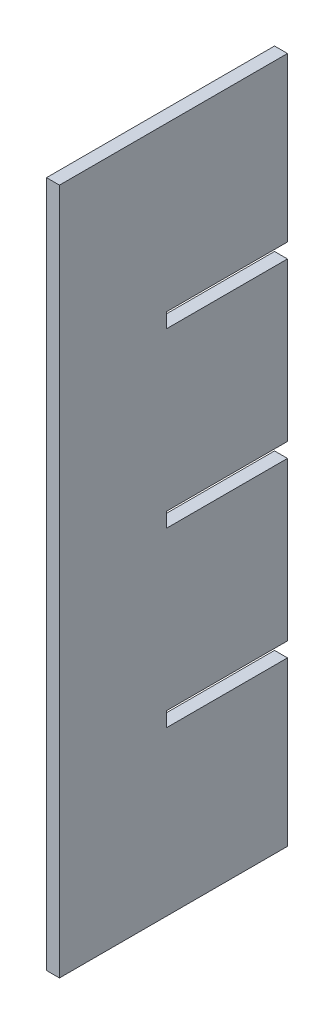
ISO-10303-21;
HEADER;
FILE_DESCRIPTION(('STEP AP214'),'2;1');
FILE_NAME('part.step','',(''),(''),'','','');
FILE_SCHEMA(('AUTOMOTIVE_DESIGN { 1 0 10303 214 1 1 1 1 }'));
ENDSEC;
DATA;
#1=APPLICATION_CONTEXT('core data for automotive mechanical design processes');
#2=APPLICATION_PROTOCOL_DEFINITION('international standard','automotive_design',2000,#1);
#3=PRODUCT_CONTEXT('',#1,'mechanical');
#4=PRODUCT('Part','Part','',(#3));
#5=PRODUCT_RELATED_PRODUCT_CATEGORY('part','',(#4));
#6=PRODUCT_DEFINITION_FORMATION('','',#4);
#7=PRODUCT_DEFINITION_CONTEXT('part definition',#1,'design');
#8=PRODUCT_DEFINITION('design','',#6,#7);
#9=PRODUCT_DEFINITION_SHAPE('','',#8);
#10=(LENGTH_UNIT() NAMED_UNIT(*) SI_UNIT(.MILLI.,.METRE.));
#11=(NAMED_UNIT(*) PLANE_ANGLE_UNIT() SI_UNIT($,.RADIAN.));
#12=(NAMED_UNIT(*) SI_UNIT($,.STERADIAN.) SOLID_ANGLE_UNIT());
#13=UNCERTAINTY_MEASURE_WITH_UNIT(LENGTH_MEASURE(1.E-05),#10,'distance_accuracy_value','');
#14=(GEOMETRIC_REPRESENTATION_CONTEXT(3) GLOBAL_UNCERTAINTY_ASSIGNED_CONTEXT((#13)) GLOBAL_UNIT_ASSIGNED_CONTEXT((#10,
#11,#12)) REPRESENTATION_CONTEXT('',''));
#15=CARTESIAN_POINT('',(0.,0.,0.));
#16=DIRECTION('',(0.,0.,1.));
#17=DIRECTION('',(1.,0.,0.));
#18=AXIS2_PLACEMENT_3D('',#15,#16,#17);
#19=CARTESIAN_POINT('',(0.,0.,0.));
#20=DIRECTION('',(0.,0.,-1.));
#21=DIRECTION('',(-1.,0.,0.));
#22=AXIS2_PLACEMENT_3D('',#19,#20,#21);
#23=PLANE('',#22);
#24=DIRECTION('',(1.,0.,0.));
#25=VECTOR('',#24,1.);
#26=CARTESIAN_POINT('',(-32.352836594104,19.15,0.));
#27=LINE('',#26,#25);
#28=CARTESIAN_POINT('',(-18.25,19.15,0.));
#29=VERTEX_POINT('',#28);
#30=CARTESIAN_POINT('',(-16.75,19.15,0.));
#31=VERTEX_POINT('',#30);
#32=EDGE_CURVE('E413',#29,#31,#27,.T.);
#33=ORIENTED_EDGE('',*,*,#32,.T.);
#34=DIRECTION('',(0.,1.,0.));
#35=VECTOR('',#34,1.);
#36=CARTESIAN_POINT('',(-16.75,-39.75,0.));
#37=LINE('',#36,#35);
#38=CARTESIAN_POINT('',(-16.75,0.849999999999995,0.));
#39=VERTEX_POINT('',#38);
#40=EDGE_CURVE('E172',#39,#31,#37,.T.);
#41=ORIENTED_EDGE('',*,*,#40,.F.);
#42=DIRECTION('',(1.,0.,0.));
#43=VECTOR('',#42,1.);
#44=CARTESIAN_POINT('',(-32.352836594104,0.849999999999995,0.));
#45=LINE('',#44,#43);
#46=CARTESIAN_POINT('',(-18.25,0.849999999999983,0.));
#47=VERTEX_POINT('',#46);
#48=EDGE_CURVE('E215',#47,#39,#45,.T.);
#49=ORIENTED_EDGE('',*,*,#48,.F.);
#50=DIRECTION('',(0.,-1.,0.));
#51=VECTOR('',#50,1.);
#52=CARTESIAN_POINT('',(-18.25,-39.75,0.));
#53=LINE('',#52,#51);
#54=EDGE_CURVE('E56',#29,#47,#53,.T.);
#55=ORIENTED_EDGE('',*,*,#54,.F.);
#56=EDGE_LOOP('',(#33,#41,#49,#55));
#57=FACE_BOUND('',#56,.T.);
#58=ADVANCED_FACE('F33',(#57),#23,.T.);
#59=DIRECTION('',(1.,0.,0.));
#60=VECTOR('',#59,1.);
#61=CARTESIAN_POINT('',(-32.352836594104,-0.850000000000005,0.));
#62=LINE('',#61,#60);
#63=CARTESIAN_POINT('',(-18.25,-0.850000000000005,0.));
#64=VERTEX_POINT('',#63);
#65=CARTESIAN_POINT('',(-16.75,-0.850000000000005,0.));
#66=VERTEX_POINT('',#65);
#67=EDGE_CURVE('E200',#64,#66,#62,.T.);
#68=ORIENTED_EDGE('',*,*,#67,.T.);
#69=CARTESIAN_POINT('',(-16.75,-19.15,0.));
#70=VERTEX_POINT('',#69);
#71=EDGE_CURVE('E176',#70,#66,#37,.T.);
#72=ORIENTED_EDGE('',*,*,#71,.F.);
#73=DIRECTION('',(1.,0.,0.));
#74=VECTOR('',#73,1.);
#75=CARTESIAN_POINT('',(-32.352836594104,-19.15,0.));
#76=LINE('',#75,#74);
#77=CARTESIAN_POINT('',(-18.25,-19.15,0.));
#78=VERTEX_POINT('',#77);
#79=EDGE_CURVE('E199',#78,#70,#76,.T.);
#80=ORIENTED_EDGE('',*,*,#79,.F.);
#81=EDGE_CURVE('E201',#64,#78,#53,.T.);
#82=ORIENTED_EDGE('',*,*,#81,.F.);
#83=EDGE_LOOP('',(#68,#72,#80,#82));
#84=FACE_BOUND('',#83,.T.);
#85=ADVANCED_FACE('F197',(#84),#23,.T.);
#86=DIRECTION('',(1.,0.,0.));
#87=VECTOR('',#86,1.);
#88=CARTESIAN_POINT('',(-32.352836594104,-20.85,0.));
#89=LINE('',#88,#87);
#90=CARTESIAN_POINT('',(-18.25,-20.85,0.));
#91=VERTEX_POINT('',#90);
#92=CARTESIAN_POINT('',(-16.75,-20.85,0.));
#93=VERTEX_POINT('',#92);
#94=EDGE_CURVE('E222',#91,#93,#89,.T.);
#95=ORIENTED_EDGE('',*,*,#94,.T.);
#96=CARTESIAN_POINT('',(-16.75,-39.75,0.));
#97=VERTEX_POINT('',#96);
#98=EDGE_CURVE('E175',#97,#93,#37,.T.);
#99=ORIENTED_EDGE('',*,*,#98,.F.);
#100=DIRECTION('',(1.,0.,0.));
#101=VECTOR('',#100,1.);
#102=CARTESIAN_POINT('',(-18.25,-39.75,0.));
#103=LINE('',#102,#101);
#104=CARTESIAN_POINT('',(-18.25,-39.75,0.));
#105=VERTEX_POINT('',#104);
#106=EDGE_CURVE('E173',#105,#97,#103,.T.);
#107=ORIENTED_EDGE('',*,*,#106,.F.);
#108=EDGE_CURVE('E240',#91,#105,#53,.T.);
#109=ORIENTED_EDGE('',*,*,#108,.F.);
#110=EDGE_LOOP('',(#95,#99,#107,#109));
#111=FACE_BOUND('',#110,.T.);
#112=ADVANCED_FACE('F267',(#111),#23,.T.);
#113=CARTESIAN_POINT('',(-18.25,-39.75,26.4));
#114=DIRECTION('',(1.,0.,0.));
#115=DIRECTION('',(0.,0.,-1.));
#116=AXIS2_PLACEMENT_3D('',#113,#114,#115);
#117=PLANE('',#116);
#118=DIRECTION('',(0.,1.,0.));
#119=VECTOR('',#118,1.);
#120=CARTESIAN_POINT('',(-18.25,19.15,14.));
#121=LINE('',#120,#119);
#122=CARTESIAN_POINT('',(-18.25,19.15,14.));
#123=VERTEX_POINT('',#122);
#124=CARTESIAN_POINT('',(-18.25,20.85,14.));
#125=VERTEX_POINT('',#124);
#126=EDGE_CURVE('E410',#123,#125,#121,.T.);
#127=ORIENTED_EDGE('',*,*,#126,.F.);
#128=DIRECTION('',(0.,0.,1.));
#129=VECTOR('',#128,1.);
#130=CARTESIAN_POINT('',(-18.25,19.15,0.));
#131=LINE('',#130,#129);
#132=EDGE_CURVE('E412',#29,#123,#131,.T.);
#133=ORIENTED_EDGE('',*,*,#132,.F.);
#134=ORIENTED_EDGE('',*,*,#54,.T.);
#135=DIRECTION('',(0.,0.,-1.));
#136=VECTOR('',#135,1.);
#137=CARTESIAN_POINT('',(-18.25,0.849999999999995,0.));
#138=LINE('',#137,#136);
#139=CARTESIAN_POINT('',(-18.25,0.849999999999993,14.));
#140=VERTEX_POINT('',#139);
#141=EDGE_CURVE('E217',#140,#47,#138,.T.);
#142=ORIENTED_EDGE('',*,*,#141,.F.);
#143=DIRECTION('',(0.,1.,0.));
#144=VECTOR('',#143,1.);
#145=CARTESIAN_POINT('',(-18.25,-0.850000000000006,14.));
#146=LINE('',#145,#144);
#147=CARTESIAN_POINT('',(-18.25,-0.850000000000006,14.));
#148=VERTEX_POINT('',#147);
#149=EDGE_CURVE('E204',#148,#140,#146,.T.);
#150=ORIENTED_EDGE('',*,*,#149,.F.);
#151=DIRECTION('',(0.,0.,1.));
#152=VECTOR('',#151,1.);
#153=CARTESIAN_POINT('',(-18.25,-0.850000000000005,0.));
#154=LINE('',#153,#152);
#155=EDGE_CURVE('E207',#64,#148,#154,.T.);
#156=ORIENTED_EDGE('',*,*,#155,.F.);
#157=ORIENTED_EDGE('',*,*,#81,.T.);
#158=DIRECTION('',(0.,0.,-1.));
#159=VECTOR('',#158,1.);
#160=CARTESIAN_POINT('',(-18.25,-19.15,0.));
#161=LINE('',#160,#159);
#162=CARTESIAN_POINT('',(-18.25,-19.15,14.));
#163=VERTEX_POINT('',#162);
#164=EDGE_CURVE('E224',#163,#78,#161,.T.);
#165=ORIENTED_EDGE('',*,*,#164,.F.);
#166=DIRECTION('',(0.,1.,0.));
#167=VECTOR('',#166,1.);
#168=CARTESIAN_POINT('',(-18.25,-20.85,14.));
#169=LINE('',#168,#167);
#170=CARTESIAN_POINT('',(-18.25,-20.85,14.));
#171=VERTEX_POINT('',#170);
#172=EDGE_CURVE('E219',#171,#163,#169,.T.);
#173=ORIENTED_EDGE('',*,*,#172,.F.);
#174=DIRECTION('',(0.,0.,1.));
#175=VECTOR('',#174,1.);
#176=CARTESIAN_POINT('',(-18.25,-20.85,0.));
#177=LINE('',#176,#175);
#178=EDGE_CURVE('E221',#91,#171,#177,.T.);
#179=ORIENTED_EDGE('',*,*,#178,.F.);
#180=ORIENTED_EDGE('',*,*,#108,.T.);
#181=DIRECTION('',(0.,0.,-1.));
#182=VECTOR('',#181,1.);
#183=CARTESIAN_POINT('',(-18.25,-39.75,26.4));
#184=LINE('',#183,#182);
#185=CARTESIAN_POINT('',(-18.25,-39.75,26.4));
#186=VERTEX_POINT('',#185);
#187=EDGE_CURVE('E11',#186,#105,#184,.T.);
#188=ORIENTED_EDGE('',*,*,#187,.F.);
#189=DIRECTION('',(0.,-1.,0.));
#190=VECTOR('',#189,1.);
#191=CARTESIAN_POINT('',(-18.25,-39.75,26.4));
#192=LINE('',#191,#190);
#193=CARTESIAN_POINT('',(-18.25,39.75,26.4));
#194=VERTEX_POINT('',#193);
#195=EDGE_CURVE('E184',#194,#186,#192,.T.);
#196=ORIENTED_EDGE('',*,*,#195,.F.);
#197=DIRECTION('',(0.,0.,-1.));
#198=VECTOR('',#197,1.);
#199=CARTESIAN_POINT('',(-18.25,39.75,26.4));
#200=LINE('',#199,#198);
#201=CARTESIAN_POINT('',(-18.25,39.75,0.));
#202=VERTEX_POINT('',#201);
#203=EDGE_CURVE('E249',#194,#202,#200,.T.);
#204=ORIENTED_EDGE('',*,*,#203,.T.);
#205=CARTESIAN_POINT('',(-18.25,20.85,0.));
#206=VERTEX_POINT('',#205);
#207=EDGE_CURVE('E177',#202,#206,#53,.T.);
#208=ORIENTED_EDGE('',*,*,#207,.T.);
#209=DIRECTION('',(0.,0.,-1.));
#210=VECTOR('',#209,1.);
#211=CARTESIAN_POINT('',(-18.25,20.85,0.));
#212=LINE('',#211,#210);
#213=EDGE_CURVE('E48',#125,#206,#212,.T.);
#214=ORIENTED_EDGE('',*,*,#213,.F.);
#215=EDGE_LOOP('',(#127,#133,#134,#142,#150,#156,#157,#165,#173,#179,#180,#188,#196,#204,#208,#214));
#216=FACE_BOUND('',#215,.T.);
#217=ADVANCED_FACE('F35',(#216),#117,.F.);
#218=CARTESIAN_POINT('',(-18.25,-39.75,26.4));
#219=DIRECTION('',(0.,1.,0.));
#220=DIRECTION('',(0.,0.,1.));
#221=AXIS2_PLACEMENT_3D('',#218,#219,#220);
#222=PLANE('',#221);
#223=ORIENTED_EDGE('',*,*,#106,.T.);
#224=DIRECTION('',(0.,0.,-1.));
#225=VECTOR('',#224,1.);
#226=CARTESIAN_POINT('',(-16.75,-39.75,26.4));
#227=LINE('',#226,#225);
#228=CARTESIAN_POINT('',(-16.75,-39.75,26.4));
#229=VERTEX_POINT('',#228);
#230=EDGE_CURVE('E41',#229,#97,#227,.T.);
#231=ORIENTED_EDGE('',*,*,#230,.F.);
#232=DIRECTION('',(1.,0.,0.));
#233=VECTOR('',#232,1.);
#234=CARTESIAN_POINT('',(-18.25,-39.75,26.4));
#235=LINE('',#234,#233);
#236=EDGE_CURVE('E243',#186,#229,#235,.T.);
#237=ORIENTED_EDGE('',*,*,#236,.F.);
#238=ORIENTED_EDGE('',*,*,#187,.T.);
#239=EDGE_LOOP('',(#223,#231,#237,#238));
#240=FACE_BOUND('',#239,.T.);
#241=ADVANCED_FACE('F270',(#240),#222,.F.);
#242=CARTESIAN_POINT('',(-16.75,-39.75,26.4));
#243=DIRECTION('',(-1.,0.,0.));
#244=DIRECTION('',(0.,0.,1.));
#245=AXIS2_PLACEMENT_3D('',#242,#243,#244);
#246=PLANE('',#245);
#247=ORIENTED_EDGE('',*,*,#40,.T.);
#248=DIRECTION('',(0.,0.,-1.));
#249=VECTOR('',#248,1.);
#250=CARTESIAN_POINT('',(-16.75,19.15,0.));
#251=LINE('',#250,#249);
#252=CARTESIAN_POINT('',(-16.75,19.15,14.));
#253=VERTEX_POINT('',#252);
#254=EDGE_CURVE('E157',#253,#31,#251,.T.);
#255=ORIENTED_EDGE('',*,*,#254,.F.);
#256=DIRECTION('',(0.,-1.,0.));
#257=VECTOR('',#256,1.);
#258=CARTESIAN_POINT('',(-16.75,19.15,14.));
#259=LINE('',#258,#257);
#260=CARTESIAN_POINT('',(-16.75,20.85,14.));
#261=VERTEX_POINT('',#260);
#262=EDGE_CURVE('E167',#261,#253,#259,.T.);
#263=ORIENTED_EDGE('',*,*,#262,.F.);
#264=DIRECTION('',(0.,0.,1.));
#265=VECTOR('',#264,1.);
#266=CARTESIAN_POINT('',(-16.75,20.85,0.));
#267=LINE('',#266,#265);
#268=CARTESIAN_POINT('',(-16.75,20.85,0.));
#269=VERTEX_POINT('',#268);
#270=EDGE_CURVE('E150',#269,#261,#267,.T.);
#271=ORIENTED_EDGE('',*,*,#270,.F.);
#272=CARTESIAN_POINT('',(-16.75,39.75,0.));
#273=VERTEX_POINT('',#272);
#274=EDGE_CURVE('E163',#269,#273,#37,.T.);
#275=ORIENTED_EDGE('',*,*,#274,.T.);
#276=DIRECTION('',(0.,0.,-1.));
#277=VECTOR('',#276,1.);
#278=CARTESIAN_POINT('',(-16.75,39.75,26.4));
#279=LINE('',#278,#277);
#280=CARTESIAN_POINT('',(-16.75,39.75,26.4));
#281=VERTEX_POINT('',#280);
#282=EDGE_CURVE('E279',#281,#273,#279,.T.);
#283=ORIENTED_EDGE('',*,*,#282,.F.);
#284=DIRECTION('',(0.,1.,0.));
#285=VECTOR('',#284,1.);
#286=CARTESIAN_POINT('',(-16.75,-39.75,26.4));
#287=LINE('',#286,#285);
#288=EDGE_CURVE('E245',#229,#281,#287,.T.);
#289=ORIENTED_EDGE('',*,*,#288,.F.);
#290=ORIENTED_EDGE('',*,*,#230,.T.);
#291=ORIENTED_EDGE('',*,*,#98,.T.);
#292=DIRECTION('',(0.,0.,-1.));
#293=VECTOR('',#292,1.);
#294=CARTESIAN_POINT('',(-16.75,-20.85,0.));
#295=LINE('',#294,#293);
#296=CARTESIAN_POINT('',(-16.75,-20.85,14.));
#297=VERTEX_POINT('',#296);
#298=EDGE_CURVE('E229',#297,#93,#295,.T.);
#299=ORIENTED_EDGE('',*,*,#298,.F.);
#300=DIRECTION('',(0.,-1.,0.));
#301=VECTOR('',#300,1.);
#302=CARTESIAN_POINT('',(-16.75,-20.85,14.));
#303=LINE('',#302,#301);
#304=CARTESIAN_POINT('',(-16.75,-19.15,14.));
#305=VERTEX_POINT('',#304);
#306=EDGE_CURVE('E226',#305,#297,#303,.T.);
#307=ORIENTED_EDGE('',*,*,#306,.F.);
#308=DIRECTION('',(0.,0.,1.));
#309=VECTOR('',#308,1.);
#310=CARTESIAN_POINT('',(-16.75,-19.15,0.));
#311=LINE('',#310,#309);
#312=EDGE_CURVE('E193',#70,#305,#311,.T.);
#313=ORIENTED_EDGE('',*,*,#312,.F.);
#314=ORIENTED_EDGE('',*,*,#71,.T.);
#315=DIRECTION('',(0.,0.,-1.));
#316=VECTOR('',#315,1.);
#317=CARTESIAN_POINT('',(-16.75,-0.850000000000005,0.));
#318=LINE('',#317,#316);
#319=CARTESIAN_POINT('',(-16.75,-0.850000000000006,14.));
#320=VERTEX_POINT('',#319);
#321=EDGE_CURVE('E190',#320,#66,#318,.T.);
#322=ORIENTED_EDGE('',*,*,#321,.F.);
#323=DIRECTION('',(0.,-1.,0.));
#324=VECTOR('',#323,1.);
#325=CARTESIAN_POINT('',(-16.75,-0.850000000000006,14.));
#326=LINE('',#325,#324);
#327=CARTESIAN_POINT('',(-16.75,0.849999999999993,14.));
#328=VERTEX_POINT('',#327);
#329=EDGE_CURVE('E419',#328,#320,#326,.T.);
#330=ORIENTED_EDGE('',*,*,#329,.F.);
#331=DIRECTION('',(0.,0.,1.));
#332=VECTOR('',#331,1.);
#333=CARTESIAN_POINT('',(-16.75,0.849999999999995,0.));
#334=LINE('',#333,#332);
#335=EDGE_CURVE('E416',#39,#328,#334,.T.);
#336=ORIENTED_EDGE('',*,*,#335,.F.);
#337=EDGE_LOOP('',(#247,#255,#263,#271,#275,#283,#289,#290,#291,#299,#307,#313,#314,#322,#330,#336));
#338=FACE_BOUND('',#337,.T.);
#339=ADVANCED_FACE('F161',(#338),#246,.F.);
#340=CARTESIAN_POINT('',(-18.25,39.75,26.4));
#341=DIRECTION('',(0.,-1.,0.));
#342=DIRECTION('',(0.,0.,-1.));
#343=AXIS2_PLACEMENT_3D('',#340,#341,#342);
#344=PLANE('',#343);
#345=DIRECTION('',(-1.,0.,0.));
#346=VECTOR('',#345,1.);
#347=CARTESIAN_POINT('',(-18.25,39.75,0.));
#348=LINE('',#347,#346);
#349=EDGE_CURVE('E171',#273,#202,#348,.T.);
#350=ORIENTED_EDGE('',*,*,#349,.T.);
#351=ORIENTED_EDGE('',*,*,#203,.F.);
#352=DIRECTION('',(-1.,0.,0.));
#353=VECTOR('',#352,1.);
#354=CARTESIAN_POINT('',(-18.25,39.75,26.4));
#355=LINE('',#354,#353);
#356=EDGE_CURVE('E247',#281,#194,#355,.T.);
#357=ORIENTED_EDGE('',*,*,#356,.F.);
#358=ORIENTED_EDGE('',*,*,#282,.T.);
#359=EDGE_LOOP('',(#350,#351,#357,#358));
#360=FACE_BOUND('',#359,.T.);
#361=ADVANCED_FACE('F278',(#360),#344,.F.);
#362=CARTESIAN_POINT('',(0.,0.,26.4));
#363=DIRECTION('',(0.,0.,-1.));
#364=DIRECTION('',(-1.,0.,0.));
#365=AXIS2_PLACEMENT_3D('',#362,#363,#364);
#366=PLANE('',#365);
#367=ORIENTED_EDGE('',*,*,#195,.T.);
#368=ORIENTED_EDGE('',*,*,#236,.T.);
#369=ORIENTED_EDGE('',*,*,#288,.T.);
#370=ORIENTED_EDGE('',*,*,#356,.T.);
#371=EDGE_LOOP('',(#367,#368,#369,#370));
#372=FACE_BOUND('',#371,.T.);
#373=ADVANCED_FACE('F274',(#372),#366,.F.);
#374=DIRECTION('',(1.,0.,0.));
#375=VECTOR('',#374,1.);
#376=CARTESIAN_POINT('',(-32.352836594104,20.85,0.));
#377=LINE('',#376,#375);
#378=EDGE_CURVE('E147',#206,#269,#377,.T.);
#379=ORIENTED_EDGE('',*,*,#378,.F.);
#380=ORIENTED_EDGE('',*,*,#207,.F.);
#381=ORIENTED_EDGE('',*,*,#349,.F.);
#382=ORIENTED_EDGE('',*,*,#274,.F.);
#383=EDGE_LOOP('',(#379,#380,#381,#382));
#384=FACE_BOUND('',#383,.T.);
#385=ADVANCED_FACE('F170',(#384),#23,.T.);
#386=CARTESIAN_POINT('',(-32.352836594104,-20.85,0.));
#387=DIRECTION('',(0.,-1.,0.));
#388=DIRECTION('',(0.,0.,-1.));
#389=AXIS2_PLACEMENT_3D('',#386,#387,#388);
#390=PLANE('',#389);
#391=ORIENTED_EDGE('',*,*,#178,.T.);
#392=DIRECTION('',(1.,0.,0.));
#393=VECTOR('',#392,1.);
#394=CARTESIAN_POINT('',(-32.352836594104,-20.85,14.));
#395=LINE('',#394,#393);
#396=EDGE_CURVE('E233',#171,#297,#395,.T.);
#397=ORIENTED_EDGE('',*,*,#396,.T.);
#398=ORIENTED_EDGE('',*,*,#298,.T.);
#399=ORIENTED_EDGE('',*,*,#94,.F.);
#400=EDGE_LOOP('',(#391,#397,#398,#399));
#401=FACE_BOUND('',#400,.T.);
#402=ADVANCED_FACE('F298',(#401),#390,.F.);
#403=CARTESIAN_POINT('',(-32.352836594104,-20.85,14.));
#404=DIRECTION('',(0.,0.,1.));
#405=DIRECTION('',(1.,0.,0.));
#406=AXIS2_PLACEMENT_3D('',#403,#404,#405);
#407=PLANE('',#406);
#408=ORIENTED_EDGE('',*,*,#172,.T.);
#409=DIRECTION('',(1.,0.,0.));
#410=VECTOR('',#409,1.);
#411=CARTESIAN_POINT('',(-32.352836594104,-19.15,14.));
#412=LINE('',#411,#410);
#413=EDGE_CURVE('E235',#163,#305,#412,.T.);
#414=ORIENTED_EDGE('',*,*,#413,.T.);
#415=ORIENTED_EDGE('',*,*,#306,.T.);
#416=ORIENTED_EDGE('',*,*,#396,.F.);
#417=EDGE_LOOP('',(#408,#414,#415,#416));
#418=FACE_BOUND('',#417,.T.);
#419=ADVANCED_FACE('F263',(#418),#407,.F.);
#420=CARTESIAN_POINT('',(-32.352836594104,-19.15,0.));
#421=DIRECTION('',(0.,1.,0.));
#422=DIRECTION('',(0.,0.,1.));
#423=AXIS2_PLACEMENT_3D('',#420,#421,#422);
#424=PLANE('',#423);
#425=ORIENTED_EDGE('',*,*,#164,.T.);
#426=ORIENTED_EDGE('',*,*,#79,.T.);
#427=ORIENTED_EDGE('',*,*,#312,.T.);
#428=ORIENTED_EDGE('',*,*,#413,.F.);
#429=EDGE_LOOP('',(#425,#426,#427,#428));
#430=FACE_BOUND('',#429,.T.);
#431=ADVANCED_FACE('F261',(#430),#424,.F.);
#432=CARTESIAN_POINT('',(-32.352836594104,-0.850000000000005,0.));
#433=DIRECTION('',(0.,-1.,0.));
#434=DIRECTION('',(0.,0.,-1.));
#435=AXIS2_PLACEMENT_3D('',#432,#433,#434);
#436=PLANE('',#435);
#437=ORIENTED_EDGE('',*,*,#155,.T.);
#438=DIRECTION('',(1.,0.,0.));
#439=VECTOR('',#438,1.);
#440=CARTESIAN_POINT('',(-32.352836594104,-0.850000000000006,14.));
#441=LINE('',#440,#439);
#442=EDGE_CURVE('E205',#148,#320,#441,.T.);
#443=ORIENTED_EDGE('',*,*,#442,.T.);
#444=ORIENTED_EDGE('',*,*,#321,.T.);
#445=ORIENTED_EDGE('',*,*,#67,.F.);
#446=EDGE_LOOP('',(#437,#443,#444,#445));
#447=FACE_BOUND('',#446,.T.);
#448=ADVANCED_FACE('F349',(#447),#436,.F.);
#449=CARTESIAN_POINT('',(-32.352836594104,-0.850000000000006,14.));
#450=DIRECTION('',(0.,0.,1.));
#451=DIRECTION('',(1.,0.,0.));
#452=AXIS2_PLACEMENT_3D('',#449,#450,#451);
#453=PLANE('',#452);
#454=ORIENTED_EDGE('',*,*,#149,.T.);
#455=DIRECTION('',(1.,0.,0.));
#456=VECTOR('',#455,1.);
#457=CARTESIAN_POINT('',(-32.352836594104,0.849999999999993,14.));
#458=LINE('',#457,#456);
#459=EDGE_CURVE('E209',#140,#328,#458,.T.);
#460=ORIENTED_EDGE('',*,*,#459,.T.);
#461=ORIENTED_EDGE('',*,*,#329,.T.);
#462=ORIENTED_EDGE('',*,*,#442,.F.);
#463=EDGE_LOOP('',(#454,#460,#461,#462));
#464=FACE_BOUND('',#463,.T.);
#465=ADVANCED_FACE('F358',(#464),#453,.F.);
#466=CARTESIAN_POINT('',(-32.352836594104,0.849999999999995,0.));
#467=DIRECTION('',(0.,1.,0.));
#468=DIRECTION('',(0.,0.,1.));
#469=AXIS2_PLACEMENT_3D('',#466,#467,#468);
#470=PLANE('',#469);
#471=ORIENTED_EDGE('',*,*,#141,.T.);
#472=ORIENTED_EDGE('',*,*,#48,.T.);
#473=ORIENTED_EDGE('',*,*,#335,.T.);
#474=ORIENTED_EDGE('',*,*,#459,.F.);
#475=EDGE_LOOP('',(#471,#472,#473,#474));
#476=FACE_BOUND('',#475,.T.);
#477=ADVANCED_FACE('F367',(#476),#470,.F.);
#478=CARTESIAN_POINT('',(-32.352836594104,19.15,0.));
#479=DIRECTION('',(0.,-1.,0.));
#480=DIRECTION('',(0.,0.,-1.));
#481=AXIS2_PLACEMENT_3D('',#478,#479,#480);
#482=PLANE('',#481);
#483=ORIENTED_EDGE('',*,*,#132,.T.);
#484=DIRECTION('',(1.,0.,0.));
#485=VECTOR('',#484,1.);
#486=CARTESIAN_POINT('',(-32.352836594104,19.15,14.));
#487=LINE('',#486,#485);
#488=EDGE_CURVE('E411',#123,#253,#487,.T.);
#489=ORIENTED_EDGE('',*,*,#488,.T.);
#490=ORIENTED_EDGE('',*,*,#254,.T.);
#491=ORIENTED_EDGE('',*,*,#32,.F.);
#492=EDGE_LOOP('',(#483,#489,#490,#491));
#493=FACE_BOUND('',#492,.T.);
#494=ADVANCED_FACE('F377',(#493),#482,.F.);
#495=CARTESIAN_POINT('',(-32.352836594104,19.15,14.));
#496=DIRECTION('',(0.,0.,1.));
#497=DIRECTION('',(1.,0.,0.));
#498=AXIS2_PLACEMENT_3D('',#495,#496,#497);
#499=PLANE('',#498);
#500=ORIENTED_EDGE('',*,*,#126,.T.);
#501=DIRECTION('',(1.,0.,0.));
#502=VECTOR('',#501,1.);
#503=CARTESIAN_POINT('',(-32.352836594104,20.85,14.));
#504=LINE('',#503,#502);
#505=EDGE_CURVE('E156',#125,#261,#504,.T.);
#506=ORIENTED_EDGE('',*,*,#505,.T.);
#507=ORIENTED_EDGE('',*,*,#262,.T.);
#508=ORIENTED_EDGE('',*,*,#488,.F.);
#509=EDGE_LOOP('',(#500,#506,#507,#508));
#510=FACE_BOUND('',#509,.T.);
#511=ADVANCED_FACE('F387',(#510),#499,.F.);
#512=CARTESIAN_POINT('',(-32.352836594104,20.85,0.));
#513=DIRECTION('',(0.,1.,0.));
#514=DIRECTION('',(0.,0.,1.));
#515=AXIS2_PLACEMENT_3D('',#512,#513,#514);
#516=PLANE('',#515);
#517=ORIENTED_EDGE('',*,*,#213,.T.);
#518=ORIENTED_EDGE('',*,*,#378,.T.);
#519=ORIENTED_EDGE('',*,*,#270,.T.);
#520=ORIENTED_EDGE('',*,*,#505,.F.);
#521=EDGE_LOOP('',(#517,#518,#519,#520));
#522=FACE_BOUND('',#521,.T.);
#523=ADVANCED_FACE('F149',(#522),#516,.F.);
#524=CLOSED_SHELL('',(#58,#85,#112,#217,#241,#339,#361,#373,#385,#402,#419,#431,#448,#465,#477,
#494,#511,#523));
#525=MANIFOLD_SOLID_BREP('B2',#524);
#526=ADVANCED_BREP_SHAPE_REPRESENTATION('',(#18,#525),#14);
#527=SHAPE_DEFINITION_REPRESENTATION(#9,#526);
ENDSEC;
END-ISO-10303-21;
